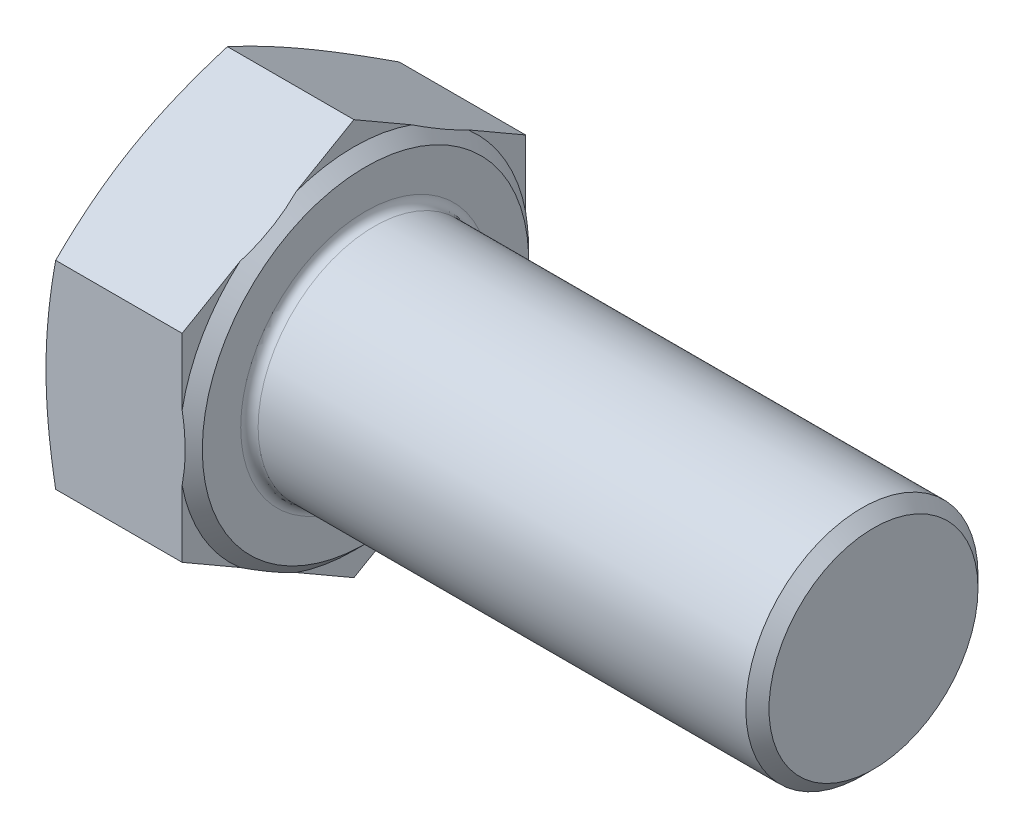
from build123d import *

# Parameters (mm, degrees)
BASEHEAD_DEPTH = 10.18
SKETCH5_R      = 8
BASEBODY_DEPTH = 35
CHAMFER1_SIZE  = 0.8
HEADFILLET_R   = 0.6


with BuildPart() as part:
    # Sketch2 → BaseHead (new body)
    with BuildSketch(Plane(origin=(0, 0, 0), x_dir=(0, 0, -1), z_dir=(1, 0, 0))):
        Polygon((11.835, -6.832940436), (11.835, 6.832940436), (0, 13.665880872), (-11.835, 6.832940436), (-11.835, -6.832940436), (0, -13.665880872), align=None)
    extrude(amount=BASEHEAD_DEPTH)

    # Sketch3 → BearingFace (revolve, cut)
    with BuildSketch(Plane.XY, mode=Mode.PRIVATE) as bearingface_sk:
        Polygon((10.18, 13.665880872), (10.18, 11.245), (9.38, 12.045), (9.38, 13.665880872), align=None)
    revolve(bearingface_sk.sketch.rotate(Axis((-0.957090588, 0, 0), (1, 0, 0)), 90), axis=Axis((-0.957090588, 0, 0), (1, 0, 0)), mode=Mode.SUBTRACT)

    # Sketch4 → HeadChamfer (revolve, cut)
    with BuildSketch(Plane.XY):
        Polygon((0, 13.665880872), (0.66638614, 13.665880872), (0, 11.835), align=None)
    revolve(axis=Axis((-0.493528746, 0, 0), (1, 0, 0)), mode=Mode.SUBTRACT)

    # Sketch5 → BaseBody (add)
    with BuildSketch(Plane(origin=(10.18, 0, 0), x_dir=(0, 0, -1), z_dir=(1, 0, 0))):
        Circle(SKETCH5_R)
    extrude(amount=BASEBODY_DEPTH)

    # Chamfer1
    chamfer1_edges = [part.edges().sort_by_distance(p)[0] for p in [
        (45.18, 0, 8),
    ]]
    chamfer(chamfer1_edges, length=CHAMFER1_SIZE)

    # HeadFillet
    headfillet_edges = [part.edges().sort_by_distance(p)[0] for p in [
        (10.18, 0, 8),
    ]]
    fillet(headfillet_edges, radius=HEADFILLET_R)


solid = part.part
